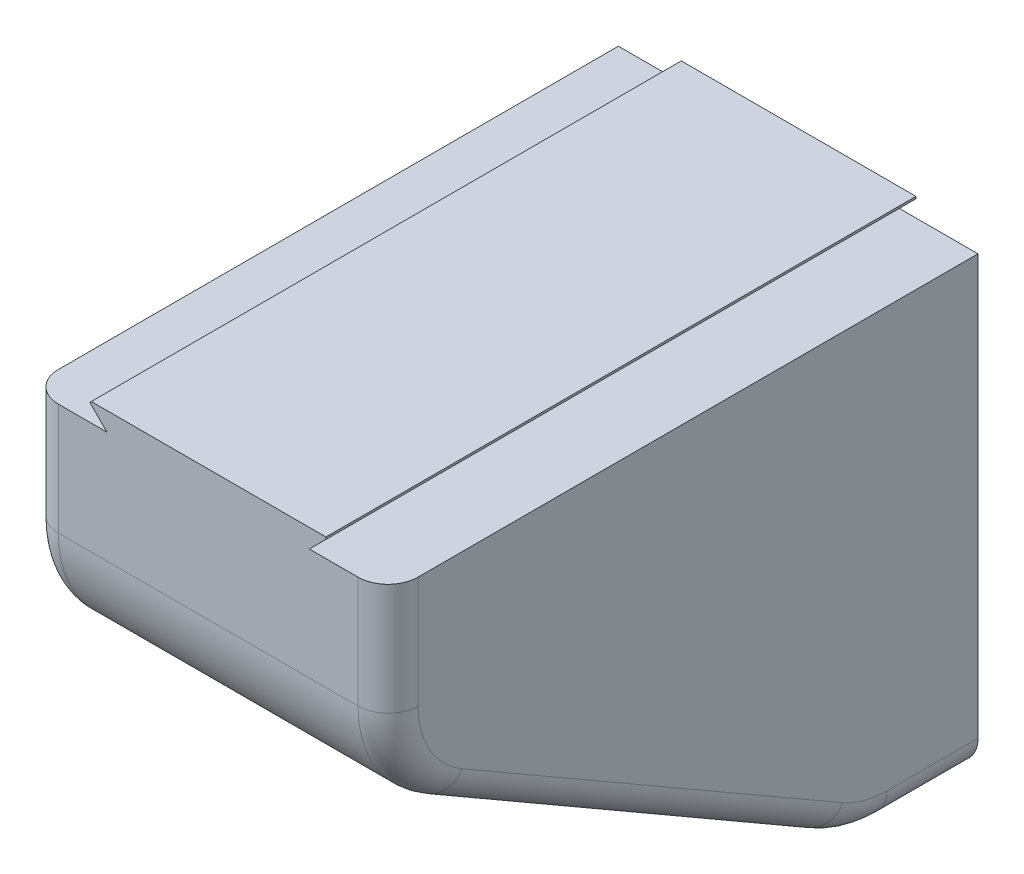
ISO-10303-21;
HEADER;
FILE_DESCRIPTION(('STEP AP214'),'2;1');
FILE_NAME('part.step','',(''),(''),'','','');
FILE_SCHEMA(('AUTOMOTIVE_DESIGN { 1 0 10303 214 1 1 1 1 }'));
ENDSEC;
DATA;
#1=APPLICATION_CONTEXT('core data for automotive mechanical design processes');
#2=APPLICATION_PROTOCOL_DEFINITION('international standard','automotive_design',2000,#1);
#3=PRODUCT_CONTEXT('',#1,'mechanical');
#4=PRODUCT('Part','Part','',(#3));
#5=PRODUCT_RELATED_PRODUCT_CATEGORY('part','',(#4));
#6=PRODUCT_DEFINITION_FORMATION('','',#4);
#7=PRODUCT_DEFINITION_CONTEXT('part definition',#1,'design');
#8=PRODUCT_DEFINITION('design','',#6,#7);
#9=PRODUCT_DEFINITION_SHAPE('','',#8);
#10=(LENGTH_UNIT() NAMED_UNIT(*) SI_UNIT(.MILLI.,.METRE.));
#11=(NAMED_UNIT(*) PLANE_ANGLE_UNIT() SI_UNIT($,.RADIAN.));
#12=(NAMED_UNIT(*) SI_UNIT($,.STERADIAN.) SOLID_ANGLE_UNIT());
#13=UNCERTAINTY_MEASURE_WITH_UNIT(LENGTH_MEASURE(1.E-05),#10,'distance_accuracy_value','');
#14=(GEOMETRIC_REPRESENTATION_CONTEXT(3) GLOBAL_UNCERTAINTY_ASSIGNED_CONTEXT((#13)) GLOBAL_UNIT_ASSIGNED_CONTEXT((#10,
#11,#12)) REPRESENTATION_CONTEXT('',''));
#15=CARTESIAN_POINT('',(0.,0.,0.));
#16=DIRECTION('',(0.,0.,1.));
#17=DIRECTION('',(1.,0.,0.));
#18=AXIS2_PLACEMENT_3D('',#15,#16,#17);
#19=CARTESIAN_POINT('',(152.4,0.,0.));
#20=DIRECTION('',(0.,-1.,0.));
#21=DIRECTION('',(0.,0.,-1.));
#22=AXIS2_PLACEMENT_3D('',#19,#20,#21);
#23=PLANE('',#22);
#24=DIRECTION('',(-1.,0.,0.));
#25=VECTOR('',#24,1.);
#26=CARTESIAN_POINT('',(152.4,0.,500.));
#27=LINE('',#26,#25);
#28=CARTESIAN_POINT('',(127.,0.,500.));
#29=VERTEX_POINT('',#28);
#30=CARTESIAN_POINT('',(85.7249999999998,0.,500.));
#31=VERTEX_POINT('',#30);
#32=EDGE_CURVE('E194',#29,#31,#27,.T.);
#33=ORIENTED_EDGE('',*,*,#32,.F.);
#34=CARTESIAN_POINT('',(127.,0.,474.6));
#35=DIRECTION('',(0.,-1.,0.));
#36=DIRECTION('',(0.,0.,-1.));
#37=AXIS2_PLACEMENT_3D('',#34,#35,#36);
#38=CIRCLE('',#37,25.4);
#39=CARTESIAN_POINT('',(152.4,0.,474.6));
#40=VERTEX_POINT('',#39);
#41=EDGE_CURVE('E11',#29,#40,#38,.F.);
#42=ORIENTED_EDGE('',*,*,#41,.T.);
#43=DIRECTION('',(0.,0.,1.));
#44=VECTOR('',#43,1.);
#45=CARTESIAN_POINT('',(152.4,0.,0.));
#46=LINE('',#45,#44);
#47=CARTESIAN_POINT('',(152.4,0.,0.));
#48=VERTEX_POINT('',#47);
#49=EDGE_CURVE('E187',#48,#40,#46,.T.);
#50=ORIENTED_EDGE('',*,*,#49,.F.);
#51=DIRECTION('',(-1.,0.,0.));
#52=VECTOR('',#51,1.);
#53=CARTESIAN_POINT('',(152.4,0.,0.));
#54=LINE('',#53,#52);
#55=CARTESIAN_POINT('',(85.7249999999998,0.,0.));
#56=VERTEX_POINT('',#55);
#57=EDGE_CURVE('E167',#48,#56,#54,.T.);
#58=ORIENTED_EDGE('',*,*,#57,.T.);
#59=DIRECTION('',(0.,0.,-1.));
#60=VECTOR('',#59,1.);
#61=CARTESIAN_POINT('',(85.7249999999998,0.,500.));
#62=LINE('',#61,#60);
#63=EDGE_CURVE('E177',#31,#56,#62,.T.);
#64=ORIENTED_EDGE('',*,*,#63,.F.);
#65=EDGE_LOOP('',(#33,#42,#50,#58,#64));
#66=FACE_BOUND('',#65,.T.);
#67=ADVANCED_FACE('F30',(#66),#23,.F.);
#68=CARTESIAN_POINT('',(152.4,-381.,0.));
#69=DIRECTION('',(0.,0.,1.));
#70=DIRECTION('',(1.,0.,0.));
#71=AXIS2_PLACEMENT_3D('',#68,#69,#70);
#72=PLANE('',#71);
#73=DIRECTION('',(-1.,0.,0.));
#74=VECTOR('',#73,1.);
#75=CARTESIAN_POINT('',(152.4,-381.,0.));
#76=LINE('',#75,#74);
#77=CARTESIAN_POINT('',(127.,-381.,0.));
#78=VERTEX_POINT('',#77);
#79=CARTESIAN_POINT('',(-127.,-381.,0.));
#80=VERTEX_POINT('',#79);
#81=EDGE_CURVE('E205',#78,#80,#76,.T.);
#82=ORIENTED_EDGE('',*,*,#81,.T.);
#83=CARTESIAN_POINT('',(-127.,-355.6,0.));
#84=DIRECTION('',(0.,0.,1.));
#85=DIRECTION('',(1.,0.,0.));
#86=AXIS2_PLACEMENT_3D('',#83,#84,#85);
#87=CIRCLE('',#86,25.4);
#88=CARTESIAN_POINT('',(-152.4,-355.6,0.));
#89=VERTEX_POINT('',#88);
#90=EDGE_CURVE('E314',#80,#89,#87,.F.);
#91=ORIENTED_EDGE('',*,*,#90,.T.);
#92=DIRECTION('',(0.,1.,0.));
#93=VECTOR('',#92,1.);
#94=CARTESIAN_POINT('',(-152.4,-381.,0.));
#95=LINE('',#94,#93);
#96=CARTESIAN_POINT('',(-152.4,0.,0.));
#97=VERTEX_POINT('',#96);
#98=EDGE_CURVE('E182',#89,#97,#95,.T.);
#99=ORIENTED_EDGE('',*,*,#98,.T.);
#100=CARTESIAN_POINT('',(-85.7250000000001,0.,0.));
#101=VERTEX_POINT('',#100);
#102=EDGE_CURVE('E189',#101,#97,#54,.T.);
#103=ORIENTED_EDGE('',*,*,#102,.F.);
#104=DIRECTION('',(-0.707106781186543,0.707106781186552,0.));
#105=VECTOR('',#104,1.);
#106=CARTESIAN_POINT('',(-101.6,15.875,0.));
#107=LINE('',#106,#105);
#108=CARTESIAN_POINT('',(-100.33,14.605,0.));
#109=VERTEX_POINT('',#108);
#110=EDGE_CURVE('E240',#101,#109,#107,.T.);
#111=ORIENTED_EDGE('',*,*,#110,.T.);
#112=DIRECTION('',(-0.707106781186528,-0.707106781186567,0.));
#113=VECTOR('',#112,1.);
#114=CARTESIAN_POINT('',(-100.33,14.605,0.));
#115=LINE('',#114,#113);
#116=CARTESIAN_POINT('',(-99.0600000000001,15.875,0.));
#117=VERTEX_POINT('',#116);
#118=EDGE_CURVE('E368',#109,#117,#115,.F.);
#119=ORIENTED_EDGE('',*,*,#118,.T.);
#120=DIRECTION('',(1.,0.,0.));
#121=VECTOR('',#120,1.);
#122=CARTESIAN_POINT('',(101.6,15.875,0.));
#123=LINE('',#122,#121);
#124=CARTESIAN_POINT('',(99.8039487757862,15.875,0.));
#125=VERTEX_POINT('',#124);
#126=EDGE_CURVE('E173',#117,#125,#123,.T.);
#127=ORIENTED_EDGE('',*,*,#126,.T.);
#128=DIRECTION('',(0.,1.,0.));
#129=VECTOR('',#128,1.);
#130=CARTESIAN_POINT('',(99.8039487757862,15.875,0.));
#131=LINE('',#130,#129);
#132=CARTESIAN_POINT('',(99.8039487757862,14.0789487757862,0.));
#133=VERTEX_POINT('',#132);
#134=EDGE_CURVE('E169',#125,#133,#131,.F.);
#135=ORIENTED_EDGE('',*,*,#134,.T.);
#136=DIRECTION('',(-0.707106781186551,-0.707106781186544,0.));
#137=VECTOR('',#136,1.);
#138=CARTESIAN_POINT('',(85.7249999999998,0.,0.));
#139=LINE('',#138,#137);
#140=EDGE_CURVE('E162',#133,#56,#139,.T.);
#141=ORIENTED_EDGE('',*,*,#140,.T.);
#142=ORIENTED_EDGE('',*,*,#57,.F.);
#143=DIRECTION('',(0.,1.,0.));
#144=VECTOR('',#143,1.);
#145=CARTESIAN_POINT('',(152.4,-381.,0.));
#146=LINE('',#145,#144);
#147=CARTESIAN_POINT('',(152.4,-355.6,0.));
#148=VERTEX_POINT('',#147);
#149=EDGE_CURVE('E264',#148,#48,#146,.T.);
#150=ORIENTED_EDGE('',*,*,#149,.F.);
#151=CARTESIAN_POINT('',(127.,-355.6,0.));
#152=DIRECTION('',(0.,0.,1.));
#153=DIRECTION('',(1.,0.,0.));
#154=AXIS2_PLACEMENT_3D('',#151,#152,#153);
#155=CIRCLE('',#154,25.4);
#156=EDGE_CURVE('E267',#148,#78,#155,.F.);
#157=ORIENTED_EDGE('',*,*,#156,.T.);
#158=EDGE_LOOP('',(#82,#91,#99,#103,#111,#119,#127,#135,#141,#142,#150,#157));
#159=FACE_BOUND('',#158,.T.);
#160=ADVANCED_FACE('F32',(#159),#72,.F.);
#161=DIRECTION('',(0.,0.,1.));
#162=VECTOR('',#161,1.);
#163=CARTESIAN_POINT('',(-152.4,0.,0.));
#164=LINE('',#163,#162);
#165=CARTESIAN_POINT('',(-152.4,0.,474.6));
#166=VERTEX_POINT('',#165);
#167=EDGE_CURVE('E269',#97,#166,#164,.T.);
#168=ORIENTED_EDGE('',*,*,#167,.T.);
#169=CARTESIAN_POINT('',(-127.,0.,474.6));
#170=DIRECTION('',(0.,-1.,0.));
#171=DIRECTION('',(0.,0.,-1.));
#172=AXIS2_PLACEMENT_3D('',#169,#170,#171);
#173=CIRCLE('',#172,25.4);
#174=CARTESIAN_POINT('',(-127.,0.,500.));
#175=VERTEX_POINT('',#174);
#176=EDGE_CURVE('E38',#166,#175,#173,.F.);
#177=ORIENTED_EDGE('',*,*,#176,.T.);
#178=CARTESIAN_POINT('',(-85.7250000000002,0.,500.));
#179=VERTEX_POINT('',#178);
#180=EDGE_CURVE('E198',#179,#175,#27,.T.);
#181=ORIENTED_EDGE('',*,*,#180,.F.);
#182=DIRECTION('',(0.,0.,-1.));
#183=VECTOR('',#182,1.);
#184=CARTESIAN_POINT('',(-85.7250000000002,0.,500.));
#185=LINE('',#184,#183);
#186=EDGE_CURVE('E183',#179,#101,#185,.T.);
#187=ORIENTED_EDGE('',*,*,#186,.T.);
#188=ORIENTED_EDGE('',*,*,#102,.T.);
#189=EDGE_LOOP('',(#168,#177,#181,#187,#188));
#190=FACE_BOUND('',#189,.T.);
#191=ADVANCED_FACE('F366',(#190),#23,.F.);
#192=CARTESIAN_POINT('',(152.4,0.,500.));
#193=DIRECTION('',(0.,0.,-1.));
#194=DIRECTION('',(-1.,0.,0.));
#195=AXIS2_PLACEMENT_3D('',#192,#193,#194);
#196=PLANE('',#195);
#197=ORIENTED_EDGE('',*,*,#180,.T.);
#198=DIRECTION('',(0.,-1.,0.));
#199=VECTOR('',#198,1.);
#200=CARTESIAN_POINT('',(-127.,0.,500.));
#201=LINE('',#200,#199);
#202=CARTESIAN_POINT('',(-127.,-94.6649730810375,500.));
#203=VERTEX_POINT('',#202);
#204=EDGE_CURVE('E214',#175,#203,#201,.T.);
#205=ORIENTED_EDGE('',*,*,#204,.T.);
#206=DIRECTION('',(-1.,0.,0.));
#207=VECTOR('',#206,1.);
#208=CARTESIAN_POINT('',(152.4,-94.6649730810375,500.));
#209=LINE('',#208,#207);
#210=CARTESIAN_POINT('',(127.,-94.6649730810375,500.));
#211=VERTEX_POINT('',#210);
#212=EDGE_CURVE('E218',#203,#211,#209,.F.);
#213=ORIENTED_EDGE('',*,*,#212,.T.);
#214=DIRECTION('',(0.,-1.,0.));
#215=VECTOR('',#214,1.);
#216=CARTESIAN_POINT('',(127.,0.,500.));
#217=LINE('',#216,#215);
#218=EDGE_CURVE('E52',#211,#29,#217,.F.);
#219=ORIENTED_EDGE('',*,*,#218,.T.);
#220=ORIENTED_EDGE('',*,*,#32,.T.);
#221=DIRECTION('',(-0.707106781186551,-0.707106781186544,0.));
#222=VECTOR('',#221,1.);
#223=CARTESIAN_POINT('',(85.7249999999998,0.,500.));
#224=LINE('',#223,#222);
#225=CARTESIAN_POINT('',(99.8039487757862,14.0789487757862,500.));
#226=VERTEX_POINT('',#225);
#227=EDGE_CURVE('E180',#226,#31,#224,.T.);
#228=ORIENTED_EDGE('',*,*,#227,.F.);
#229=DIRECTION('',(0.,-1.,0.));
#230=VECTOR('',#229,1.);
#231=CARTESIAN_POINT('',(99.8039487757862,15.875,500.));
#232=LINE('',#231,#230);
#233=CARTESIAN_POINT('',(99.8039487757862,15.875,500.));
#234=VERTEX_POINT('',#233);
#235=EDGE_CURVE('E296',#226,#234,#232,.F.);
#236=ORIENTED_EDGE('',*,*,#235,.T.);
#237=DIRECTION('',(1.,0.,0.));
#238=VECTOR('',#237,1.);
#239=CARTESIAN_POINT('',(101.6,15.875,500.));
#240=LINE('',#239,#238);
#241=CARTESIAN_POINT('',(-99.0600000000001,15.875,500.));
#242=VERTEX_POINT('',#241);
#243=EDGE_CURVE('E285',#242,#234,#240,.T.);
#244=ORIENTED_EDGE('',*,*,#243,.F.);
#245=DIRECTION('',(0.707106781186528,0.707106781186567,0.));
#246=VECTOR('',#245,1.);
#247=CARTESIAN_POINT('',(-100.33,14.605,500.));
#248=LINE('',#247,#246);
#249=CARTESIAN_POINT('',(-100.33,14.605,500.));
#250=VERTEX_POINT('',#249);
#251=EDGE_CURVE('E298',#242,#250,#248,.F.);
#252=ORIENTED_EDGE('',*,*,#251,.T.);
#253=DIRECTION('',(-0.707106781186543,0.707106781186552,0.));
#254=VECTOR('',#253,1.);
#255=CARTESIAN_POINT('',(-101.6,15.875,500.));
#256=LINE('',#255,#254);
#257=EDGE_CURVE('E172',#179,#250,#256,.T.);
#258=ORIENTED_EDGE('',*,*,#257,.F.);
#259=EDGE_LOOP('',(#197,#205,#213,#219,#220,#228,#236,#244,#252,#258));
#260=FACE_BOUND('',#259,.T.);
#261=ADVANCED_FACE('F217',(#260),#196,.F.);
#262=CARTESIAN_POINT('',(152.4,-381.,104.053185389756));
#263=DIRECTION('',(0.,0.866025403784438,-0.500000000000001));
#264=DIRECTION('',(0.,0.500000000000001,0.866025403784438));
#265=AXIS2_PLACEMENT_3D('',#262,#263,#264);
#266=PLANE('',#265);
#267=DIRECTION('',(-1.,0.,0.));
#268=VECTOR('',#267,1.);
#269=CARTESIAN_POINT('',(152.4,-181.267513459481,450.));
#270=LINE('',#269,#268);
#271=CARTESIAN_POINT('',(127.,-181.267513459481,450.));
#272=VERTEX_POINT('',#271);
#273=CARTESIAN_POINT('',(-127.,-181.267513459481,450.));
#274=VERTEX_POINT('',#273);
#275=EDGE_CURVE('E305',#272,#274,#270,.T.);
#276=ORIENTED_EDGE('',*,*,#275,.T.);
#277=DIRECTION('',(0.,-0.500000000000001,-0.866025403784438));
#278=VECTOR('',#277,1.);
#279=CARTESIAN_POINT('',(-127.,-381.,104.053185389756));
#280=LINE('',#279,#278);
#281=CARTESIAN_POINT('',(-127.,-367.602540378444,127.258266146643));
#282=VERTEX_POINT('',#281);
#283=EDGE_CURVE('E251',#274,#282,#280,.T.);
#284=ORIENTED_EDGE('',*,*,#283,.T.);
#285=DIRECTION('',(-1.,0.,0.));
#286=VECTOR('',#285,1.);
#287=CARTESIAN_POINT('',(152.4,-367.602540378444,127.258266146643));
#288=LINE('',#287,#286);
#289=CARTESIAN_POINT('',(127.,-367.602540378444,127.258266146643));
#290=VERTEX_POINT('',#289);
#291=EDGE_CURVE('E231',#282,#290,#288,.F.);
#292=ORIENTED_EDGE('',*,*,#291,.T.);
#293=DIRECTION('',(0.,-0.500000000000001,-0.866025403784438));
#294=VECTOR('',#293,1.);
#295=CARTESIAN_POINT('',(127.,-181.267513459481,450.));
#296=LINE('',#295,#294);
#297=EDGE_CURVE('E329',#290,#272,#296,.F.);
#298=ORIENTED_EDGE('',*,*,#297,.T.);
#299=EDGE_LOOP('',(#276,#284,#292,#298));
#300=FACE_BOUND('',#299,.T.);
#301=ADVANCED_FACE('F332',(#300),#266,.F.);
#302=CARTESIAN_POINT('',(152.4,-381.,0.));
#303=DIRECTION('',(0.,1.,0.));
#304=DIRECTION('',(0.,0.,1.));
#305=AXIS2_PLACEMENT_3D('',#302,#303,#304);
#306=PLANE('',#305);
#307=DIRECTION('',(-1.,0.,0.));
#308=VECTOR('',#307,1.);
#309=CARTESIAN_POINT('',(152.4,-381.,77.2582661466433));
#310=LINE('',#309,#308);
#311=CARTESIAN_POINT('',(127.,-381.,77.2582661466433));
#312=VERTEX_POINT('',#311);
#313=CARTESIAN_POINT('',(-127.,-381.,77.2582661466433));
#314=VERTEX_POINT('',#313);
#315=EDGE_CURVE('E302',#312,#314,#310,.T.);
#316=ORIENTED_EDGE('',*,*,#315,.T.);
#317=DIRECTION('',(0.,0.,-1.));
#318=VECTOR('',#317,1.);
#319=CARTESIAN_POINT('',(-127.,-381.,0.));
#320=LINE('',#319,#318);
#321=EDGE_CURVE('E310',#314,#80,#320,.T.);
#322=ORIENTED_EDGE('',*,*,#321,.T.);
#323=ORIENTED_EDGE('',*,*,#81,.F.);
#324=DIRECTION('',(0.,0.,-1.));
#325=VECTOR('',#324,1.);
#326=CARTESIAN_POINT('',(127.,-381.,77.2582661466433));
#327=LINE('',#326,#325);
#328=EDGE_CURVE('E230',#78,#312,#327,.F.);
#329=ORIENTED_EDGE('',*,*,#328,.T.);
#330=EDGE_LOOP('',(#316,#322,#323,#329));
#331=FACE_BOUND('',#330,.T.);
#332=ADVANCED_FACE('F359',(#331),#306,.F.);
#333=CARTESIAN_POINT('',(152.4,-381.,0.));
#334=DIRECTION('',(1.,0.,0.));
#335=DIRECTION('',(0.,0.,-1.));
#336=AXIS2_PLACEMENT_3D('',#333,#334,#335);
#337=PLANE('',#336);
#338=CARTESIAN_POINT('',(152.4,-281.,77.2582661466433));
#339=DIRECTION('',(1.,0.,0.));
#340=DIRECTION('',(0.,0.,-1.));
#341=AXIS2_PLACEMENT_3D('',#338,#339,#340);
#342=CIRCLE('',#341,74.6);
#343=CARTESIAN_POINT('',(152.4,-345.605495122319,114.558266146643));
#344=VERTEX_POINT('',#343);
#345=CARTESIAN_POINT('',(152.4,-355.6,77.2582661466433));
#346=VERTEX_POINT('',#345);
#347=EDGE_CURVE('E257',#344,#346,#342,.T.);
#348=ORIENTED_EDGE('',*,*,#347,.T.);
#349=DIRECTION('',(0.,0.,-1.));
#350=VECTOR('',#349,1.);
#351=CARTESIAN_POINT('',(152.4,-355.6,0.));
#352=LINE('',#351,#350);
#353=EDGE_CURVE('E211',#346,#148,#352,.T.);
#354=ORIENTED_EDGE('',*,*,#353,.T.);
#355=ORIENTED_EDGE('',*,*,#149,.T.);
#356=ORIENTED_EDGE('',*,*,#49,.T.);
#357=DIRECTION('',(0.,-1.,0.));
#358=VECTOR('',#357,1.);
#359=CARTESIAN_POINT('',(152.4,-94.6649730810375,474.6));
#360=LINE('',#359,#358);
#361=CARTESIAN_POINT('',(152.4,-94.6649730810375,474.6));
#362=VERTEX_POINT('',#361);
#363=EDGE_CURVE('E247',#40,#362,#360,.T.);
#364=ORIENTED_EDGE('',*,*,#363,.T.);
#365=CARTESIAN_POINT('',(152.4,-94.6649730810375,400.));
#366=DIRECTION('',(1.,0.,0.));
#367=DIRECTION('',(0.,0.,-1.));
#368=AXIS2_PLACEMENT_3D('',#365,#366,#367);
#369=CIRCLE('',#368,74.6);
#370=CARTESIAN_POINT('',(152.4,-159.270468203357,437.3));
#371=VERTEX_POINT('',#370);
#372=EDGE_CURVE('E249',#362,#371,#369,.T.);
#373=ORIENTED_EDGE('',*,*,#372,.T.);
#374=DIRECTION('',(0.,-0.500000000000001,-0.866025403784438));
#375=VECTOR('',#374,1.);
#376=CARTESIAN_POINT('',(152.4,-345.605495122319,114.558266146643));
#377=LINE('',#376,#375);
#378=EDGE_CURVE('E256',#371,#344,#377,.T.);
#379=ORIENTED_EDGE('',*,*,#378,.T.);
#380=EDGE_LOOP('',(#348,#354,#355,#356,#364,#373,#379));
#381=FACE_BOUND('',#380,.T.);
#382=ADVANCED_FACE('F263',(#381),#337,.T.);
#383=CARTESIAN_POINT('',(-152.4,-381.,0.));
#384=DIRECTION('',(1.,0.,0.));
#385=DIRECTION('',(0.,0.,-1.));
#386=AXIS2_PLACEMENT_3D('',#383,#384,#385);
#387=PLANE('',#386);
#388=ORIENTED_EDGE('',*,*,#98,.F.);
#389=DIRECTION('',(0.,0.,-1.));
#390=VECTOR('',#389,1.);
#391=CARTESIAN_POINT('',(-152.4,-355.6,0.));
#392=LINE('',#391,#390);
#393=CARTESIAN_POINT('',(-152.4,-355.6,77.2582661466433));
#394=VERTEX_POINT('',#393);
#395=EDGE_CURVE('E323',#89,#394,#392,.F.);
#396=ORIENTED_EDGE('',*,*,#395,.T.);
#397=CARTESIAN_POINT('',(-152.4,-281.,77.2582661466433));
#398=DIRECTION('',(1.,0.,0.));
#399=DIRECTION('',(0.,0.,-1.));
#400=AXIS2_PLACEMENT_3D('',#397,#398,#399);
#401=CIRCLE('',#400,74.6);
#402=CARTESIAN_POINT('',(-152.4,-345.605495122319,114.558266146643));
#403=VERTEX_POINT('',#402);
#404=EDGE_CURVE('E321',#394,#403,#401,.F.);
#405=ORIENTED_EDGE('',*,*,#404,.T.);
#406=DIRECTION('',(0.,-0.500000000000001,-0.866025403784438));
#407=VECTOR('',#406,1.);
#408=CARTESIAN_POINT('',(-152.4,-404.059305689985,13.313296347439));
#409=LINE('',#408,#407);
#410=CARTESIAN_POINT('',(-152.4,-159.270468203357,437.3));
#411=VERTEX_POINT('',#410);
#412=EDGE_CURVE('E319',#403,#411,#409,.F.);
#413=ORIENTED_EDGE('',*,*,#412,.T.);
#414=CARTESIAN_POINT('',(-152.4,-94.6649730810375,400.));
#415=DIRECTION('',(1.,0.,0.));
#416=DIRECTION('',(0.,0.,-1.));
#417=AXIS2_PLACEMENT_3D('',#414,#415,#416);
#418=CIRCLE('',#417,74.6);
#419=CARTESIAN_POINT('',(-152.4,-94.6649730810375,474.6));
#420=VERTEX_POINT('',#419);
#421=EDGE_CURVE('E317',#411,#420,#418,.F.);
#422=ORIENTED_EDGE('',*,*,#421,.T.);
#423=DIRECTION('',(0.,-1.,0.));
#424=VECTOR('',#423,1.);
#425=CARTESIAN_POINT('',(-152.4,-381.,474.6));
#426=LINE('',#425,#424);
#427=EDGE_CURVE('E237',#420,#166,#426,.F.);
#428=ORIENTED_EDGE('',*,*,#427,.T.);
#429=ORIENTED_EDGE('',*,*,#167,.F.);
#430=EDGE_LOOP('',(#388,#396,#405,#413,#422,#428,#429));
#431=FACE_BOUND('',#430,.T.);
#432=ADVANCED_FACE('F365',(#431),#387,.F.);
#433=CARTESIAN_POINT('',(85.7249999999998,0.,500.));
#434=DIRECTION('',(0.707106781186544,-0.707106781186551,0.));
#435=DIRECTION('',(0.707106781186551,0.707106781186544,0.));
#436=AXIS2_PLACEMENT_3D('',#433,#434,#435);
#437=PLANE('',#436);
#438=ORIENTED_EDGE('',*,*,#140,.F.);
#439=DIRECTION('',(0.,0.,1.));
#440=VECTOR('',#439,1.);
#441=CARTESIAN_POINT('',(99.8039487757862,14.0789487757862,500.));
#442=LINE('',#441,#440);
#443=EDGE_CURVE('E300',#133,#226,#442,.T.);
#444=ORIENTED_EDGE('',*,*,#443,.T.);
#445=ORIENTED_EDGE('',*,*,#227,.T.);
#446=ORIENTED_EDGE('',*,*,#63,.T.);
#447=EDGE_LOOP('',(#438,#444,#445,#446));
#448=FACE_BOUND('',#447,.T.);
#449=ADVANCED_FACE('F178',(#448),#437,.T.);
#450=CARTESIAN_POINT('',(101.6,15.875,500.));
#451=DIRECTION('',(0.,1.,0.));
#452=DIRECTION('',(0.,0.,1.));
#453=AXIS2_PLACEMENT_3D('',#450,#451,#452);
#454=PLANE('',#453);
#455=ORIENTED_EDGE('',*,*,#126,.F.);
#456=DIRECTION('',(0.,0.,1.));
#457=VECTOR('',#456,1.);
#458=CARTESIAN_POINT('',(-99.0600000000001,15.875,500.));
#459=LINE('',#458,#457);
#460=EDGE_CURVE('E294',#117,#242,#459,.T.);
#461=ORIENTED_EDGE('',*,*,#460,.T.);
#462=ORIENTED_EDGE('',*,*,#243,.T.);
#463=DIRECTION('',(0.,0.,-1.));
#464=VECTOR('',#463,1.);
#465=CARTESIAN_POINT('',(99.8039487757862,15.875,500.));
#466=LINE('',#465,#464);
#467=EDGE_CURVE('E379',#234,#125,#466,.T.);
#468=ORIENTED_EDGE('',*,*,#467,.T.);
#469=EDGE_LOOP('',(#455,#461,#462,#468));
#470=FACE_BOUND('',#469,.T.);
#471=ADVANCED_FACE('F378',(#470),#454,.T.);
#472=CARTESIAN_POINT('',(-101.6,15.875,500.));
#473=DIRECTION('',(-0.707106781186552,-0.707106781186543,0.));
#474=DIRECTION('',(0.707106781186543,-0.707106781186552,0.));
#475=AXIS2_PLACEMENT_3D('',#472,#473,#474);
#476=PLANE('',#475);
#477=ORIENTED_EDGE('',*,*,#257,.T.);
#478=DIRECTION('',(0.,0.,-1.));
#479=VECTOR('',#478,1.);
#480=CARTESIAN_POINT('',(-100.33,14.605,500.));
#481=LINE('',#480,#479);
#482=EDGE_CURVE('E188',#250,#109,#481,.T.);
#483=ORIENTED_EDGE('',*,*,#482,.T.);
#484=ORIENTED_EDGE('',*,*,#110,.F.);
#485=ORIENTED_EDGE('',*,*,#186,.F.);
#486=EDGE_LOOP('',(#477,#483,#484,#485));
#487=FACE_BOUND('',#486,.T.);
#488=ADVANCED_FACE('F439',(#487),#476,.T.);
#489=CARTESIAN_POINT('',(-100.33,14.605,500.));
#490=DIRECTION('',(0.707106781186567,-0.707106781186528,0.));
#491=DIRECTION('',(0.707106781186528,0.707106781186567,0.));
#492=AXIS2_PLACEMENT_3D('',#489,#490,#491);
#493=PLANE('',#492);
#494=ORIENTED_EDGE('',*,*,#251,.F.);
#495=ORIENTED_EDGE('',*,*,#460,.F.);
#496=ORIENTED_EDGE('',*,*,#118,.F.);
#497=ORIENTED_EDGE('',*,*,#482,.F.);
#498=EDGE_LOOP('',(#494,#495,#496,#497));
#499=FACE_BOUND('',#498,.T.);
#500=ADVANCED_FACE('F442',(#499),#493,.F.);
#501=CARTESIAN_POINT('',(99.8039487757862,15.875,500.));
#502=DIRECTION('',(-1.,0.,0.));
#503=DIRECTION('',(0.,-1.,0.));
#504=AXIS2_PLACEMENT_3D('',#501,#502,#503);
#505=PLANE('',#504);
#506=ORIENTED_EDGE('',*,*,#235,.F.);
#507=ORIENTED_EDGE('',*,*,#443,.F.);
#508=ORIENTED_EDGE('',*,*,#134,.F.);
#509=ORIENTED_EDGE('',*,*,#467,.F.);
#510=EDGE_LOOP('',(#506,#507,#508,#509));
#511=FACE_BOUND('',#510,.T.);
#512=ADVANCED_FACE('F384',(#511),#505,.F.);
#513=CARTESIAN_POINT('',(152.4,-281.,77.2582661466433));
#514=DIRECTION('',(-1.,0.,0.));
#515=DIRECTION('',(0.,0.,1.));
#516=AXIS2_PLACEMENT_3D('',#513,#514,#515);
#517=CYLINDRICAL_SURFACE('',#516,100.);
#518=ORIENTED_EDGE('',*,*,#291,.F.);
#519=CARTESIAN_POINT('',(-127.,-281.,77.2582661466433));
#520=DIRECTION('',(1.,0.,0.));
#521=DIRECTION('',(0.,0.,-1.));
#522=AXIS2_PLACEMENT_3D('',#519,#520,#521);
#523=CIRCLE('',#522,100.);
#524=EDGE_CURVE('E327',#282,#314,#523,.T.);
#525=ORIENTED_EDGE('',*,*,#524,.T.);
#526=ORIENTED_EDGE('',*,*,#315,.F.);
#527=CARTESIAN_POINT('',(127.,-281.,77.2582661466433));
#528=DIRECTION('',(1.,0.,0.));
#529=DIRECTION('',(0.,0.,-1.));
#530=AXIS2_PLACEMENT_3D('',#527,#528,#529);
#531=CIRCLE('',#530,100.);
#532=EDGE_CURVE('E325',#312,#290,#531,.F.);
#533=ORIENTED_EDGE('',*,*,#532,.T.);
#534=EDGE_LOOP('',(#518,#525,#526,#533));
#535=FACE_BOUND('',#534,.T.);
#536=ADVANCED_FACE('F337',(#535),#517,.T.);
#537=CARTESIAN_POINT('',(152.4,-94.6649730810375,400.));
#538=DIRECTION('',(-1.,0.,0.));
#539=DIRECTION('',(0.,0.,1.));
#540=AXIS2_PLACEMENT_3D('',#537,#538,#539);
#541=CYLINDRICAL_SURFACE('',#540,100.);
#542=ORIENTED_EDGE('',*,*,#212,.F.);
#543=CARTESIAN_POINT('',(-127.,-94.6649730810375,400.));
#544=DIRECTION('',(1.,0.,0.));
#545=DIRECTION('',(0.,0.,-1.));
#546=AXIS2_PLACEMENT_3D('',#543,#544,#545);
#547=CIRCLE('',#546,100.);
#548=EDGE_CURVE('E226',#203,#274,#547,.T.);
#549=ORIENTED_EDGE('',*,*,#548,.T.);
#550=ORIENTED_EDGE('',*,*,#275,.F.);
#551=CARTESIAN_POINT('',(127.,-94.6649730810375,400.));
#552=DIRECTION('',(1.,0.,0.));
#553=DIRECTION('',(0.,0.,-1.));
#554=AXIS2_PLACEMENT_3D('',#551,#552,#553);
#555=CIRCLE('',#554,100.);
#556=EDGE_CURVE('E229',#272,#211,#555,.F.);
#557=ORIENTED_EDGE('',*,*,#556,.T.);
#558=EDGE_LOOP('',(#542,#549,#550,#557));
#559=FACE_BOUND('',#558,.T.);
#560=ADVANCED_FACE('F223',(#559),#541,.T.);
#561=CARTESIAN_POINT('',(-127.,0.,474.6));
#562=DIRECTION('',(0.,-1.,0.));
#563=DIRECTION('',(0.,0.,-1.));
#564=AXIS2_PLACEMENT_3D('',#561,#562,#563);
#565=CYLINDRICAL_SURFACE('',#564,25.4);
#566=ORIENTED_EDGE('',*,*,#176,.F.);
#567=ORIENTED_EDGE('',*,*,#427,.F.);
#568=CARTESIAN_POINT('',(-127.,-94.6649730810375,474.6));
#569=DIRECTION('',(0.,-1.,0.));
#570=DIRECTION('',(0.,0.,-1.));
#571=AXIS2_PLACEMENT_3D('',#568,#569,#570);
#572=CIRCLE('',#571,25.4);
#573=EDGE_CURVE('E235',#203,#420,#572,.T.);
#574=ORIENTED_EDGE('',*,*,#573,.F.);
#575=ORIENTED_EDGE('',*,*,#204,.F.);
#576=EDGE_LOOP('',(#566,#567,#574,#575));
#577=FACE_BOUND('',#576,.T.);
#578=ADVANCED_FACE('F236',(#577),#565,.T.);
#579=CARTESIAN_POINT('',(-127.,-94.6649730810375,400.));
#580=DIRECTION('',(1.,0.,0.));
#581=DIRECTION('',(0.,0.,-1.));
#582=AXIS2_PLACEMENT_3D('',#579,#580,#581);
#583=TOROIDAL_SURFACE('',#582,74.6,25.4);
#584=ORIENTED_EDGE('',*,*,#573,.T.);
#585=ORIENTED_EDGE('',*,*,#421,.F.);
#586=CARTESIAN_POINT('',(-127.,-159.270468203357,437.3));
#587=DIRECTION('',(0.,-0.500000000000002,-0.866025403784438));
#588=DIRECTION('',(0.,0.866025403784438,-0.500000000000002));
#589=AXIS2_PLACEMENT_3D('',#586,#587,#588);
#590=CIRCLE('',#589,25.4);
#591=EDGE_CURVE('E241',#274,#411,#590,.T.);
#592=ORIENTED_EDGE('',*,*,#591,.F.);
#593=ORIENTED_EDGE('',*,*,#548,.F.);
#594=EDGE_LOOP('',(#584,#585,#592,#593));
#595=FACE_BOUND('',#594,.T.);
#596=ADVANCED_FACE('F244',(#595),#583,.T.);
#597=CARTESIAN_POINT('',(-127.,-359.002954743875,91.3531853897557));
#598=DIRECTION('',(0.,-0.500000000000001,-0.866025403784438));
#599=DIRECTION('',(0.,0.866025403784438,-0.500000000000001));
#600=AXIS2_PLACEMENT_3D('',#597,#598,#599);
#601=CYLINDRICAL_SURFACE('',#600,25.4);
#602=ORIENTED_EDGE('',*,*,#591,.T.);
#603=ORIENTED_EDGE('',*,*,#412,.F.);
#604=CARTESIAN_POINT('',(-127.,-345.605495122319,114.558266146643));
#605=DIRECTION('',(0.,-0.500000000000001,-0.866025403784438));
#606=DIRECTION('',(0.,0.866025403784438,-0.500000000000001));
#607=AXIS2_PLACEMENT_3D('',#604,#605,#606);
#608=CIRCLE('',#607,25.4);
#609=EDGE_CURVE('E343',#282,#403,#608,.T.);
#610=ORIENTED_EDGE('',*,*,#609,.F.);
#611=ORIENTED_EDGE('',*,*,#283,.F.);
#612=EDGE_LOOP('',(#602,#603,#610,#611));
#613=FACE_BOUND('',#612,.T.);
#614=ADVANCED_FACE('F344',(#613),#601,.T.);
#615=CARTESIAN_POINT('',(-127.,-281.,77.2582661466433));
#616=DIRECTION('',(1.,0.,0.));
#617=DIRECTION('',(0.,0.,-1.));
#618=AXIS2_PLACEMENT_3D('',#615,#616,#617);
#619=TOROIDAL_SURFACE('',#618,74.6,25.4);
#620=ORIENTED_EDGE('',*,*,#609,.T.);
#621=ORIENTED_EDGE('',*,*,#404,.F.);
#622=CARTESIAN_POINT('',(-127.,-355.6,77.2582661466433));
#623=DIRECTION('',(0.,0.,-1.));
#624=DIRECTION('',(-1.,0.,0.));
#625=AXIS2_PLACEMENT_3D('',#622,#623,#624);
#626=CIRCLE('',#625,25.4);
#627=EDGE_CURVE('E347',#314,#394,#626,.T.);
#628=ORIENTED_EDGE('',*,*,#627,.F.);
#629=ORIENTED_EDGE('',*,*,#524,.F.);
#630=EDGE_LOOP('',(#620,#621,#628,#629));
#631=FACE_BOUND('',#630,.T.);
#632=ADVANCED_FACE('F350',(#631),#619,.T.);
#633=CARTESIAN_POINT('',(-127.,-355.6,0.));
#634=DIRECTION('',(0.,0.,-1.));
#635=DIRECTION('',(-1.,0.,0.));
#636=AXIS2_PLACEMENT_3D('',#633,#634,#635);
#637=CYLINDRICAL_SURFACE('',#636,25.4);
#638=ORIENTED_EDGE('',*,*,#627,.T.);
#639=ORIENTED_EDGE('',*,*,#395,.F.);
#640=ORIENTED_EDGE('',*,*,#90,.F.);
#641=ORIENTED_EDGE('',*,*,#321,.F.);
#642=EDGE_LOOP('',(#638,#639,#640,#641));
#643=FACE_BOUND('',#642,.T.);
#644=ADVANCED_FACE('F357',(#643),#637,.T.);
#645=CARTESIAN_POINT('',(127.,-381.,474.6));
#646=DIRECTION('',(0.,1.,0.));
#647=DIRECTION('',(0.,0.,1.));
#648=AXIS2_PLACEMENT_3D('',#645,#646,#647);
#649=CYLINDRICAL_SURFACE('',#648,25.4);
#650=ORIENTED_EDGE('',*,*,#41,.F.);
#651=ORIENTED_EDGE('',*,*,#218,.F.);
#652=CARTESIAN_POINT('',(127.,-94.6649730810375,474.6));
#653=DIRECTION('',(0.,-1.,0.));
#654=DIRECTION('',(0.,0.,-1.));
#655=AXIS2_PLACEMENT_3D('',#652,#653,#654);
#656=CIRCLE('',#655,25.4);
#657=EDGE_CURVE('E355',#362,#211,#656,.T.);
#658=ORIENTED_EDGE('',*,*,#657,.F.);
#659=ORIENTED_EDGE('',*,*,#363,.F.);
#660=EDGE_LOOP('',(#650,#651,#658,#659));
#661=FACE_BOUND('',#660,.T.);
#662=ADVANCED_FACE('F390',(#661),#649,.T.);
#663=CARTESIAN_POINT('',(127.,-94.6649730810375,400.));
#664=DIRECTION('',(1.,0.,0.));
#665=DIRECTION('',(0.,0.,-1.));
#666=AXIS2_PLACEMENT_3D('',#663,#664,#665);
#667=TOROIDAL_SURFACE('',#666,74.6,25.4);
#668=ORIENTED_EDGE('',*,*,#657,.T.);
#669=ORIENTED_EDGE('',*,*,#556,.F.);
#670=CARTESIAN_POINT('',(127.,-159.270468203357,437.3));
#671=DIRECTION('',(0.,-0.500000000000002,-0.866025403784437));
#672=DIRECTION('',(0.,0.866025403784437,-0.500000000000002));
#673=AXIS2_PLACEMENT_3D('',#670,#671,#672);
#674=CIRCLE('',#673,25.4);
#675=EDGE_CURVE('E399',#371,#272,#674,.T.);
#676=ORIENTED_EDGE('',*,*,#675,.F.);
#677=ORIENTED_EDGE('',*,*,#372,.F.);
#678=EDGE_LOOP('',(#668,#669,#676,#677));
#679=FACE_BOUND('',#678,.T.);
#680=ADVANCED_FACE('F400',(#679),#667,.T.);
#681=CARTESIAN_POINT('',(127.,-404.059305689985,13.313296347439));
#682=DIRECTION('',(0.,0.500000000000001,0.866025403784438));
#683=DIRECTION('',(0.,-0.866025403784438,0.500000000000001));
#684=AXIS2_PLACEMENT_3D('',#681,#682,#683);
#685=CYLINDRICAL_SURFACE('',#684,25.4);
#686=ORIENTED_EDGE('',*,*,#675,.T.);
#687=ORIENTED_EDGE('',*,*,#297,.F.);
#688=CARTESIAN_POINT('',(127.,-345.605495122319,114.558266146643));
#689=DIRECTION('',(0.,-0.5,-0.866025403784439));
#690=DIRECTION('',(0.,0.866025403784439,-0.5));
#691=AXIS2_PLACEMENT_3D('',#688,#689,#690);
#692=CIRCLE('',#691,25.4);
#693=EDGE_CURVE('E402',#344,#290,#692,.T.);
#694=ORIENTED_EDGE('',*,*,#693,.F.);
#695=ORIENTED_EDGE('',*,*,#378,.F.);
#696=EDGE_LOOP('',(#686,#687,#694,#695));
#697=FACE_BOUND('',#696,.T.);
#698=ADVANCED_FACE('F404',(#697),#685,.T.);
#699=CARTESIAN_POINT('',(127.,-281.,77.2582661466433));
#700=DIRECTION('',(1.,0.,0.));
#701=DIRECTION('',(0.,0.,-1.));
#702=AXIS2_PLACEMENT_3D('',#699,#700,#701);
#703=TOROIDAL_SURFACE('',#702,74.6,25.4);
#704=ORIENTED_EDGE('',*,*,#693,.T.);
#705=ORIENTED_EDGE('',*,*,#532,.F.);
#706=CARTESIAN_POINT('',(127.,-355.6,77.2582661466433));
#707=DIRECTION('',(0.,0.,-1.));
#708=DIRECTION('',(-1.,0.,0.));
#709=AXIS2_PLACEMENT_3D('',#706,#707,#708);
#710=CIRCLE('',#709,25.4);
#711=EDGE_CURVE('E407',#346,#312,#710,.T.);
#712=ORIENTED_EDGE('',*,*,#711,.F.);
#713=ORIENTED_EDGE('',*,*,#347,.F.);
#714=EDGE_LOOP('',(#704,#705,#712,#713));
#715=FACE_BOUND('',#714,.T.);
#716=ADVANCED_FACE('F409',(#715),#703,.T.);
#717=CARTESIAN_POINT('',(127.,-355.6,0.));
#718=DIRECTION('',(0.,0.,1.));
#719=DIRECTION('',(1.,0.,0.));
#720=AXIS2_PLACEMENT_3D('',#717,#718,#719);
#721=CYLINDRICAL_SURFACE('',#720,25.4);
#722=ORIENTED_EDGE('',*,*,#711,.T.);
#723=ORIENTED_EDGE('',*,*,#328,.F.);
#724=ORIENTED_EDGE('',*,*,#156,.F.);
#725=ORIENTED_EDGE('',*,*,#353,.F.);
#726=EDGE_LOOP('',(#722,#723,#724,#725));
#727=FACE_BOUND('',#726,.T.);
#728=ADVANCED_FACE('F412',(#727),#721,.T.);
#729=CLOSED_SHELL('',(#67,#160,#191,#261,#301,#332,#382,#432,#449,#471,#488,#500,#512,#536,#560,
#578,#596,#614,#632,#644,#662,#680,#698,#716,#728));
#730=MANIFOLD_SOLID_BREP('B2',#729);
#731=ADVANCED_BREP_SHAPE_REPRESENTATION('',(#18,#730),#14);
#732=SHAPE_DEFINITION_REPRESENTATION(#9,#731);
ENDSEC;
END-ISO-10303-21;
